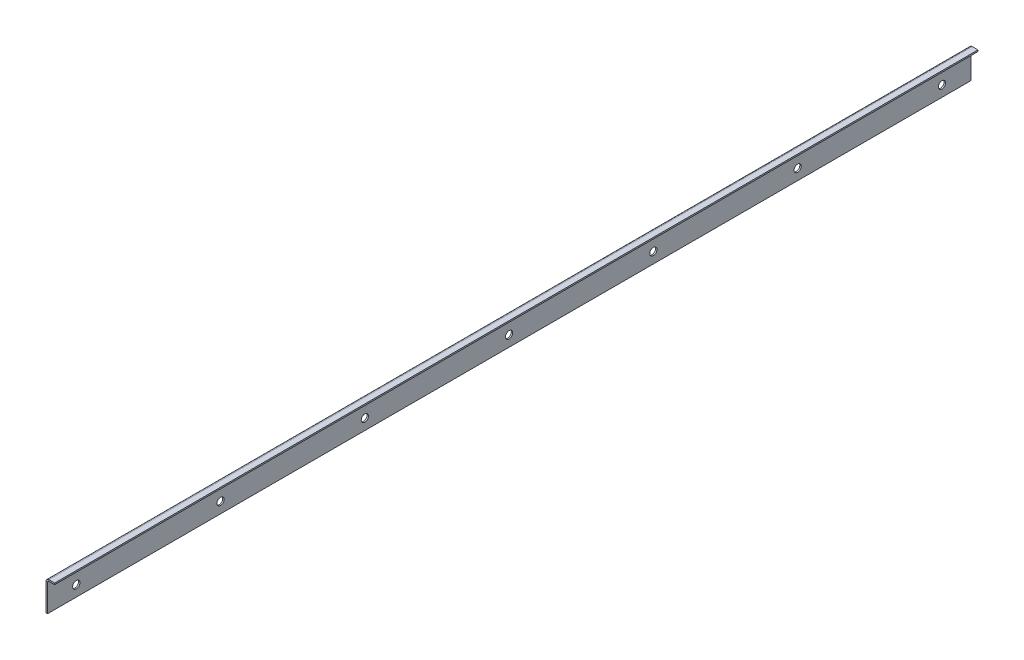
ISO-10303-21;
HEADER;
FILE_DESCRIPTION(('STEP AP214'),'2;1');
FILE_NAME('part.step','',(''),(''),'','','');
FILE_SCHEMA(('AUTOMOTIVE_DESIGN { 1 0 10303 214 1 1 1 1 }'));
ENDSEC;
DATA;
#1=APPLICATION_CONTEXT('core data for automotive mechanical design processes');
#2=APPLICATION_PROTOCOL_DEFINITION('international standard','automotive_design',2000,#1);
#3=PRODUCT_CONTEXT('',#1,'mechanical');
#4=PRODUCT('Part','Part','',(#3));
#5=PRODUCT_RELATED_PRODUCT_CATEGORY('part','',(#4));
#6=PRODUCT_DEFINITION_FORMATION('','',#4);
#7=PRODUCT_DEFINITION_CONTEXT('part definition',#1,'design');
#8=PRODUCT_DEFINITION('design','',#6,#7);
#9=PRODUCT_DEFINITION_SHAPE('','',#8);
#10=(LENGTH_UNIT() NAMED_UNIT(*) SI_UNIT(.MILLI.,.METRE.));
#11=(NAMED_UNIT(*) PLANE_ANGLE_UNIT() SI_UNIT($,.RADIAN.));
#12=(NAMED_UNIT(*) SI_UNIT($,.STERADIAN.) SOLID_ANGLE_UNIT());
#13=UNCERTAINTY_MEASURE_WITH_UNIT(LENGTH_MEASURE(1.E-05),#10,'distance_accuracy_value','');
#14=(GEOMETRIC_REPRESENTATION_CONTEXT(3) GLOBAL_UNCERTAINTY_ASSIGNED_CONTEXT((#13)) GLOBAL_UNIT_ASSIGNED_CONTEXT((#10,
#11,#12)) REPRESENTATION_CONTEXT('',''));
#15=CARTESIAN_POINT('',(0.,0.,0.));
#16=DIRECTION('',(0.,0.,1.));
#17=DIRECTION('',(1.,0.,0.));
#18=AXIS2_PLACEMENT_3D('',#15,#16,#17);
#19=CARTESIAN_POINT('',(2.,21.,320.));
#20=DIRECTION('',(0.,0.,1.));
#21=DIRECTION('',(1.,0.,0.));
#22=AXIS2_PLACEMENT_3D('',#19,#20,#21);
#23=PLANE('',#22);
#24=DIRECTION('',(0.,-1.,0.));
#25=VECTOR('',#24,1.);
#26=CARTESIAN_POINT('',(2.,21.,320.));
#27=LINE('',#26,#25);
#28=CARTESIAN_POINT('',(2.,21.,320.));
#29=VERTEX_POINT('',#28);
#30=CARTESIAN_POINT('',(2.,20.,320.));
#31=VERTEX_POINT('',#30);
#32=EDGE_CURVE('E68',#29,#31,#27,.T.);
#33=ORIENTED_EDGE('',*,*,#32,.F.);
#34=CARTESIAN_POINT('',(2.,19.,320.));
#35=DIRECTION('',(0.,0.,1.));
#36=DIRECTION('',(1.,0.,0.));
#37=AXIS2_PLACEMENT_3D('',#34,#35,#36);
#38=CIRCLE('',#37,2.);
#39=CARTESIAN_POINT('',(0.,19.,320.));
#40=VERTEX_POINT('',#39);
#41=EDGE_CURVE('E182',#40,#29,#38,.F.);
#42=ORIENTED_EDGE('',*,*,#41,.F.);
#43=DIRECTION('',(-1.,0.,0.));
#44=VECTOR('',#43,1.);
#45=CARTESIAN_POINT('',(0.999999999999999,19.,320.));
#46=LINE('',#45,#44);
#47=CARTESIAN_POINT('',(0.999999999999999,19.,320.));
#48=VERTEX_POINT('',#47);
#49=EDGE_CURVE('E75',#48,#40,#46,.T.);
#50=ORIENTED_EDGE('',*,*,#49,.F.);
#51=CARTESIAN_POINT('',(2.,19.,320.));
#52=DIRECTION('',(0.,0.,1.));
#53=DIRECTION('',(1.,0.,0.));
#54=AXIS2_PLACEMENT_3D('',#51,#52,#53);
#55=CIRCLE('',#54,1.);
#56=EDGE_CURVE('E197',#48,#31,#55,.F.);
#57=ORIENTED_EDGE('',*,*,#56,.T.);
#58=EDGE_LOOP('',(#33,#42,#50,#57));
#59=FACE_BOUND('',#58,.T.);
#60=ADVANCED_FACE('F52',(#59),#23,.T.);
#61=CARTESIAN_POINT('',(0.999999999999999,19.,320.));
#62=DIRECTION('',(0.,0.,1.));
#63=DIRECTION('',(1.,0.,0.));
#64=AXIS2_PLACEMENT_3D('',#61,#62,#63);
#65=PLANE('',#64);
#66=DIRECTION('',(1.,0.,0.));
#67=VECTOR('',#66,1.);
#68=CARTESIAN_POINT('',(0.,21.,320.));
#69=LINE('',#68,#67);
#70=CARTESIAN_POINT('',(6.,21.,320.));
#71=VERTEX_POINT('',#70);
#72=EDGE_CURVE('E178',#29,#71,#69,.T.);
#73=ORIENTED_EDGE('',*,*,#72,.F.);
#74=ORIENTED_EDGE('',*,*,#32,.T.);
#75=DIRECTION('',(1.,0.,0.));
#76=VECTOR('',#75,1.);
#77=CARTESIAN_POINT('',(0.,20.,320.));
#78=LINE('',#77,#76);
#79=CARTESIAN_POINT('',(6.,20.,320.));
#80=VERTEX_POINT('',#79);
#81=EDGE_CURVE('E173',#31,#80,#78,.T.);
#82=ORIENTED_EDGE('',*,*,#81,.T.);
#83=DIRECTION('',(0.,-1.,0.));
#84=VECTOR('',#83,1.);
#85=CARTESIAN_POINT('',(6.,21.,320.));
#86=LINE('',#85,#84);
#87=EDGE_CURVE('E126',#71,#80,#86,.T.);
#88=ORIENTED_EDGE('',*,*,#87,.F.);
#89=EDGE_LOOP('',(#73,#74,#82,#88));
#90=FACE_BOUND('',#89,.T.);
#91=ADVANCED_FACE('F286',(#90),#65,.T.);
#92=CARTESIAN_POINT('',(0.,19.,-320.));
#93=DIRECTION('',(0.,0.,-1.));
#94=DIRECTION('',(-1.,0.,0.));
#95=AXIS2_PLACEMENT_3D('',#92,#93,#94);
#96=PLANE('',#95);
#97=DIRECTION('',(1.,0.,0.));
#98=VECTOR('',#97,1.);
#99=CARTESIAN_POINT('',(0.,19.,-320.));
#100=LINE('',#99,#98);
#101=CARTESIAN_POINT('',(0.,19.,-320.));
#102=VERTEX_POINT('',#101);
#103=CARTESIAN_POINT('',(1.,19.,-320.));
#104=VERTEX_POINT('',#103);
#105=EDGE_CURVE('E224',#102,#104,#100,.T.);
#106=ORIENTED_EDGE('',*,*,#105,.F.);
#107=CARTESIAN_POINT('',(2.,19.,-320.));
#108=DIRECTION('',(0.,0.,1.));
#109=DIRECTION('',(1.,0.,0.));
#110=AXIS2_PLACEMENT_3D('',#107,#108,#109);
#111=CIRCLE('',#110,2.);
#112=CARTESIAN_POINT('',(2.,21.,-320.));
#113=VERTEX_POINT('',#112);
#114=EDGE_CURVE('E151',#102,#113,#111,.F.);
#115=ORIENTED_EDGE('',*,*,#114,.T.);
#116=DIRECTION('',(0.,1.,0.));
#117=VECTOR('',#116,1.);
#118=CARTESIAN_POINT('',(2.,20.,-320.));
#119=LINE('',#118,#117);
#120=CARTESIAN_POINT('',(2.,20.,-320.));
#121=VERTEX_POINT('',#120);
#122=EDGE_CURVE('E130',#121,#113,#119,.T.);
#123=ORIENTED_EDGE('',*,*,#122,.F.);
#124=CARTESIAN_POINT('',(2.,19.,-320.));
#125=DIRECTION('',(0.,0.,1.));
#126=DIRECTION('',(1.,0.,0.));
#127=AXIS2_PLACEMENT_3D('',#124,#125,#126);
#128=CIRCLE('',#127,1.);
#129=EDGE_CURVE('E169',#104,#121,#128,.F.);
#130=ORIENTED_EDGE('',*,*,#129,.F.);
#131=EDGE_LOOP('',(#106,#115,#123,#130));
#132=FACE_BOUND('',#131,.T.);
#133=ADVANCED_FACE('F291',(#132),#96,.T.);
#134=CARTESIAN_POINT('',(2.,20.,-320.));
#135=DIRECTION('',(0.,0.,-1.));
#136=DIRECTION('',(-1.,0.,0.));
#137=AXIS2_PLACEMENT_3D('',#134,#135,#136);
#138=PLANE('',#137);
#139=DIRECTION('',(0.,1.,0.));
#140=VECTOR('',#139,1.);
#141=CARTESIAN_POINT('',(0.,0.,-320.));
#142=LINE('',#141,#140);
#143=CARTESIAN_POINT('',(0.,0.,-320.));
#144=VERTEX_POINT('',#143);
#145=EDGE_CURVE('E158',#144,#102,#142,.T.);
#146=ORIENTED_EDGE('',*,*,#145,.T.);
#147=ORIENTED_EDGE('',*,*,#105,.T.);
#148=DIRECTION('',(0.,1.,0.));
#149=VECTOR('',#148,1.);
#150=CARTESIAN_POINT('',(1.,0.,-320.));
#151=LINE('',#150,#149);
#152=CARTESIAN_POINT('',(1.,0.,-320.));
#153=VERTEX_POINT('',#152);
#154=EDGE_CURVE('E166',#153,#104,#151,.T.);
#155=ORIENTED_EDGE('',*,*,#154,.F.);
#156=DIRECTION('',(-1.,0.,0.));
#157=VECTOR('',#156,1.);
#158=CARTESIAN_POINT('',(1.,0.,-320.));
#159=LINE('',#158,#157);
#160=EDGE_CURVE('E162',#153,#144,#159,.T.);
#161=ORIENTED_EDGE('',*,*,#160,.T.);
#162=EDGE_LOOP('',(#146,#147,#155,#161));
#163=FACE_BOUND('',#162,.T.);
#164=ADVANCED_FACE('F393',(#163),#138,.T.);
#165=CARTESIAN_POINT('',(0.,20.,320.));
#166=DIRECTION('',(0.,1.,0.));
#167=DIRECTION('',(0.,0.,1.));
#168=AXIS2_PLACEMENT_3D('',#165,#166,#167);
#169=PLANE('',#168);
#170=DIRECTION('',(1.,0.,0.));
#171=VECTOR('',#170,1.);
#172=CARTESIAN_POINT('',(0.,20.,-320.));
#173=LINE('',#172,#171);
#174=CARTESIAN_POINT('',(6.,20.,-320.));
#175=VERTEX_POINT('',#174);
#176=EDGE_CURVE('E135',#121,#175,#173,.T.);
#177=ORIENTED_EDGE('',*,*,#176,.T.);
#178=DIRECTION('',(0.,0.,-1.));
#179=VECTOR('',#178,1.);
#180=CARTESIAN_POINT('',(6.,20.,320.));
#181=LINE('',#180,#179);
#182=EDGE_CURVE('E119',#80,#175,#181,.T.);
#183=ORIENTED_EDGE('',*,*,#182,.F.);
#184=ORIENTED_EDGE('',*,*,#81,.F.);
#185=DIRECTION('',(0.,0.,-1.));
#186=VECTOR('',#185,1.);
#187=CARTESIAN_POINT('',(2.,20.,320.));
#188=LINE('',#187,#186);
#189=EDGE_CURVE('E138',#31,#121,#188,.T.);
#190=ORIENTED_EDGE('',*,*,#189,.T.);
#191=EDGE_LOOP('',(#177,#183,#184,#190));
#192=FACE_BOUND('',#191,.T.);
#193=ADVANCED_FACE('F136',(#192),#169,.F.);
#194=CARTESIAN_POINT('',(6.,21.,320.));
#195=DIRECTION('',(1.,0.,0.));
#196=DIRECTION('',(0.,0.,-1.));
#197=AXIS2_PLACEMENT_3D('',#194,#195,#196);
#198=PLANE('',#197);
#199=DIRECTION('',(0.,-1.,0.));
#200=VECTOR('',#199,1.);
#201=CARTESIAN_POINT('',(6.,21.,-320.));
#202=LINE('',#201,#200);
#203=CARTESIAN_POINT('',(6.,21.,-320.));
#204=VERTEX_POINT('',#203);
#205=EDGE_CURVE('E123',#204,#175,#202,.T.);
#206=ORIENTED_EDGE('',*,*,#205,.F.);
#207=DIRECTION('',(0.,0.,-1.));
#208=VECTOR('',#207,1.);
#209=CARTESIAN_POINT('',(6.,21.,320.));
#210=LINE('',#209,#208);
#211=EDGE_CURVE('E131',#71,#204,#210,.T.);
#212=ORIENTED_EDGE('',*,*,#211,.F.);
#213=ORIENTED_EDGE('',*,*,#87,.T.);
#214=ORIENTED_EDGE('',*,*,#182,.T.);
#215=EDGE_LOOP('',(#206,#212,#213,#214));
#216=FACE_BOUND('',#215,.T.);
#217=ADVANCED_FACE('F121',(#216),#198,.T.);
#218=CARTESIAN_POINT('',(0.,21.,320.));
#219=DIRECTION('',(0.,1.,0.));
#220=DIRECTION('',(0.,0.,1.));
#221=AXIS2_PLACEMENT_3D('',#218,#219,#220);
#222=PLANE('',#221);
#223=DIRECTION('',(1.,0.,0.));
#224=VECTOR('',#223,1.);
#225=CARTESIAN_POINT('',(0.,21.,-320.));
#226=LINE('',#225,#224);
#227=EDGE_CURVE('E145',#113,#204,#226,.T.);
#228=ORIENTED_EDGE('',*,*,#227,.F.);
#229=DIRECTION('',(0.,0.,-1.));
#230=VECTOR('',#229,1.);
#231=CARTESIAN_POINT('',(2.,21.,320.));
#232=LINE('',#231,#230);
#233=EDGE_CURVE('E216',#29,#113,#232,.T.);
#234=ORIENTED_EDGE('',*,*,#233,.F.);
#235=ORIENTED_EDGE('',*,*,#72,.T.);
#236=ORIENTED_EDGE('',*,*,#211,.T.);
#237=EDGE_LOOP('',(#228,#234,#235,#236));
#238=FACE_BOUND('',#237,.T.);
#239=ADVANCED_FACE('F280',(#238),#222,.T.);
#240=CARTESIAN_POINT('',(2.,19.,320.));
#241=DIRECTION('',(0.,0.,-1.));
#242=DIRECTION('',(-1.,0.,0.));
#243=AXIS2_PLACEMENT_3D('',#240,#241,#242);
#244=CYLINDRICAL_SURFACE('',#243,2.);
#245=ORIENTED_EDGE('',*,*,#114,.F.);
#246=DIRECTION('',(0.,0.,-1.));
#247=VECTOR('',#246,1.);
#248=CARTESIAN_POINT('',(0.,19.,320.));
#249=LINE('',#248,#247);
#250=EDGE_CURVE('E212',#40,#102,#249,.T.);
#251=ORIENTED_EDGE('',*,*,#250,.F.);
#252=ORIENTED_EDGE('',*,*,#41,.T.);
#253=ORIENTED_EDGE('',*,*,#233,.T.);
#254=EDGE_LOOP('',(#245,#251,#252,#253));
#255=FACE_BOUND('',#254,.T.);
#256=ADVANCED_FACE('F270',(#255),#244,.T.);
#257=CARTESIAN_POINT('',(0.,0.,320.));
#258=DIRECTION('',(-1.,0.,0.));
#259=DIRECTION('',(0.,0.,1.));
#260=AXIS2_PLACEMENT_3D('',#257,#258,#259);
#261=PLANE('',#260);
#262=CARTESIAN_POINT('',(0.,7.50000000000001,-200.));
#263=DIRECTION('',(-1.,0.,0.));
#264=DIRECTION('',(0.,0.,1.));
#265=AXIS2_PLACEMENT_3D('',#262,#263,#264);
#266=CIRCLE('',#265,2.50000000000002);
#267=CARTESIAN_POINT('',(0.,7.50000000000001,-197.5));
#268=VERTEX_POINT('',#267);
#269=EDGE_CURVE('E347',#268,#268,#266,.T.);
#270=ORIENTED_EDGE('',*,*,#269,.F.);
#271=EDGE_LOOP('',(#270));
#272=FACE_BOUND('',#271,.T.);
#273=CARTESIAN_POINT('',(0.,7.50000000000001,-300.));
#274=DIRECTION('',(-1.,0.,0.));
#275=DIRECTION('',(0.,0.,1.));
#276=AXIS2_PLACEMENT_3D('',#273,#274,#275);
#277=CIRCLE('',#276,2.50000000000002);
#278=CARTESIAN_POINT('',(0.,7.50000000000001,-297.5));
#279=VERTEX_POINT('',#278);
#280=EDGE_CURVE('E351',#279,#279,#277,.T.);
#281=ORIENTED_EDGE('',*,*,#280,.F.);
#282=EDGE_LOOP('',(#281));
#283=FACE_BOUND('',#282,.T.);
#284=ORIENTED_EDGE('',*,*,#145,.F.);
#285=DIRECTION('',(0.,0.,-1.));
#286=VECTOR('',#285,1.);
#287=CARTESIAN_POINT('',(0.,0.,320.));
#288=LINE('',#287,#286);
#289=CARTESIAN_POINT('',(0.,0.,320.));
#290=VERTEX_POINT('',#289);
#291=EDGE_CURVE('E209',#290,#144,#288,.T.);
#292=ORIENTED_EDGE('',*,*,#291,.F.);
#293=DIRECTION('',(0.,1.,0.));
#294=VECTOR('',#293,1.);
#295=CARTESIAN_POINT('',(0.,0.,320.));
#296=LINE('',#295,#294);
#297=EDGE_CURVE('E186',#290,#40,#296,.T.);
#298=ORIENTED_EDGE('',*,*,#297,.T.);
#299=ORIENTED_EDGE('',*,*,#250,.T.);
#300=EDGE_LOOP('',(#284,#292,#298,#299));
#301=FACE_BOUND('',#300,.T.);
#302=CARTESIAN_POINT('',(0.,7.50000000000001,-100.));
#303=DIRECTION('',(-1.,0.,0.));
#304=DIRECTION('',(0.,0.,1.));
#305=AXIS2_PLACEMENT_3D('',#302,#303,#304);
#306=CIRCLE('',#305,2.50000000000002);
#307=CARTESIAN_POINT('',(0.,7.50000000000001,-97.5));
#308=VERTEX_POINT('',#307);
#309=EDGE_CURVE('E230',#308,#308,#306,.T.);
#310=ORIENTED_EDGE('',*,*,#309,.F.);
#311=EDGE_LOOP('',(#310));
#312=FACE_BOUND('',#311,.T.);
#313=CARTESIAN_POINT('',(0.,7.50000000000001,0.));
#314=DIRECTION('',(-1.,0.,0.));
#315=DIRECTION('',(0.,0.,1.));
#316=AXIS2_PLACEMENT_3D('',#313,#314,#315);
#317=CIRCLE('',#316,2.50000000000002);
#318=CARTESIAN_POINT('',(0.,7.50000000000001,2.50000000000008));
#319=VERTEX_POINT('',#318);
#320=EDGE_CURVE('E238',#319,#319,#317,.T.);
#321=ORIENTED_EDGE('',*,*,#320,.F.);
#322=EDGE_LOOP('',(#321));
#323=FACE_BOUND('',#322,.T.);
#324=CARTESIAN_POINT('',(0.,7.50000000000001,100.));
#325=DIRECTION('',(-1.,0.,0.));
#326=DIRECTION('',(0.,0.,1.));
#327=AXIS2_PLACEMENT_3D('',#324,#325,#326);
#328=CIRCLE('',#327,2.50000000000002);
#329=CARTESIAN_POINT('',(0.,7.50000000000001,102.5));
#330=VERTEX_POINT('',#329);
#331=EDGE_CURVE('E246',#330,#330,#328,.T.);
#332=ORIENTED_EDGE('',*,*,#331,.F.);
#333=EDGE_LOOP('',(#332));
#334=FACE_BOUND('',#333,.T.);
#335=CARTESIAN_POINT('',(0.,7.50000000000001,200.));
#336=DIRECTION('',(-1.,0.,0.));
#337=DIRECTION('',(0.,0.,1.));
#338=AXIS2_PLACEMENT_3D('',#335,#336,#337);
#339=CIRCLE('',#338,2.50000000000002);
#340=CARTESIAN_POINT('',(0.,7.50000000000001,202.5));
#341=VERTEX_POINT('',#340);
#342=EDGE_CURVE('E254',#341,#341,#339,.T.);
#343=ORIENTED_EDGE('',*,*,#342,.F.);
#344=EDGE_LOOP('',(#343));
#345=FACE_BOUND('',#344,.T.);
#346=CARTESIAN_POINT('',(0.,7.50000000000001,300.));
#347=DIRECTION('',(-1.,0.,0.));
#348=DIRECTION('',(0.,0.,1.));
#349=AXIS2_PLACEMENT_3D('',#346,#347,#348);
#350=CIRCLE('',#349,2.50000000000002);
#351=CARTESIAN_POINT('',(0.,7.50000000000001,302.5));
#352=VERTEX_POINT('',#351);
#353=EDGE_CURVE('E61',#352,#352,#350,.T.);
#354=ORIENTED_EDGE('',*,*,#353,.F.);
#355=EDGE_LOOP('',(#354));
#356=FACE_BOUND('',#355,.T.);
#357=ADVANCED_FACE('F267',(#272,#283,#301,#312,#323,#334,#345,#356),#261,.T.);
#358=CARTESIAN_POINT('',(0.999999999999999,0.,320.));
#359=DIRECTION('',(0.,-1.,0.));
#360=DIRECTION('',(0.,0.,-1.));
#361=AXIS2_PLACEMENT_3D('',#358,#359,#360);
#362=PLANE('',#361);
#363=ORIENTED_EDGE('',*,*,#160,.F.);
#364=DIRECTION('',(0.,0.,-1.));
#365=VECTOR('',#364,1.);
#366=CARTESIAN_POINT('',(0.999999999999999,0.,320.));
#367=LINE('',#366,#365);
#368=CARTESIAN_POINT('',(0.999999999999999,0.,320.));
#369=VERTEX_POINT('',#368);
#370=EDGE_CURVE('E206',#369,#153,#367,.T.);
#371=ORIENTED_EDGE('',*,*,#370,.F.);
#372=DIRECTION('',(-1.,0.,0.));
#373=VECTOR('',#372,1.);
#374=CARTESIAN_POINT('',(0.999999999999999,0.,320.));
#375=LINE('',#374,#373);
#376=EDGE_CURVE('E190',#369,#290,#375,.T.);
#377=ORIENTED_EDGE('',*,*,#376,.T.);
#378=ORIENTED_EDGE('',*,*,#291,.T.);
#379=EDGE_LOOP('',(#363,#371,#377,#378));
#380=FACE_BOUND('',#379,.T.);
#381=ADVANCED_FACE('F269',(#380),#362,.T.);
#382=CARTESIAN_POINT('',(0.999999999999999,0.,320.));
#383=DIRECTION('',(-1.,0.,0.));
#384=DIRECTION('',(0.,0.,1.));
#385=AXIS2_PLACEMENT_3D('',#382,#383,#384);
#386=PLANE('',#385);
#387=CARTESIAN_POINT('',(0.999999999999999,7.50000000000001,-200.));
#388=DIRECTION('',(-1.,0.,0.));
#389=DIRECTION('',(0.,0.,1.));
#390=AXIS2_PLACEMENT_3D('',#387,#388,#389);
#391=CIRCLE('',#390,2.50000000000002);
#392=CARTESIAN_POINT('',(0.999999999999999,7.50000000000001,-197.5));
#393=VERTEX_POINT('',#392);
#394=EDGE_CURVE('E349',#393,#393,#391,.F.);
#395=ORIENTED_EDGE('',*,*,#394,.F.);
#396=EDGE_LOOP('',(#395));
#397=FACE_BOUND('',#396,.T.);
#398=CARTESIAN_POINT('',(1.,7.50000000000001,-300.));
#399=DIRECTION('',(-1.,0.,0.));
#400=DIRECTION('',(0.,0.,1.));
#401=AXIS2_PLACEMENT_3D('',#398,#399,#400);
#402=CIRCLE('',#401,2.50000000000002);
#403=CARTESIAN_POINT('',(1.,7.50000000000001,-297.5));
#404=VERTEX_POINT('',#403);
#405=EDGE_CURVE('E141',#404,#404,#402,.F.);
#406=ORIENTED_EDGE('',*,*,#405,.F.);
#407=EDGE_LOOP('',(#406));
#408=FACE_BOUND('',#407,.T.);
#409=ORIENTED_EDGE('',*,*,#154,.T.);
#410=DIRECTION('',(0.,0.,-1.));
#411=VECTOR('',#410,1.);
#412=CARTESIAN_POINT('',(0.999999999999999,19.,320.));
#413=LINE('',#412,#411);
#414=EDGE_CURVE('E202',#48,#104,#413,.T.);
#415=ORIENTED_EDGE('',*,*,#414,.F.);
#416=DIRECTION('',(0.,1.,0.));
#417=VECTOR('',#416,1.);
#418=CARTESIAN_POINT('',(0.999999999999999,0.,320.));
#419=LINE('',#418,#417);
#420=EDGE_CURVE('E194',#369,#48,#419,.T.);
#421=ORIENTED_EDGE('',*,*,#420,.F.);
#422=ORIENTED_EDGE('',*,*,#370,.T.);
#423=EDGE_LOOP('',(#409,#415,#421,#422));
#424=FACE_BOUND('',#423,.T.);
#425=CARTESIAN_POINT('',(1.,7.50000000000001,-100.));
#426=DIRECTION('',(-1.,0.,0.));
#427=DIRECTION('',(0.,0.,1.));
#428=AXIS2_PLACEMENT_3D('',#425,#426,#427);
#429=CIRCLE('',#428,2.50000000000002);
#430=CARTESIAN_POINT('',(1.,7.50000000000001,-97.5));
#431=VERTEX_POINT('',#430);
#432=EDGE_CURVE('E234',#431,#431,#429,.F.);
#433=ORIENTED_EDGE('',*,*,#432,.F.);
#434=EDGE_LOOP('',(#433));
#435=FACE_BOUND('',#434,.T.);
#436=CARTESIAN_POINT('',(1.,7.50000000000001,0.));
#437=DIRECTION('',(-1.,0.,0.));
#438=DIRECTION('',(0.,0.,1.));
#439=AXIS2_PLACEMENT_3D('',#436,#437,#438);
#440=CIRCLE('',#439,2.50000000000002);
#441=CARTESIAN_POINT('',(1.,7.50000000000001,2.50000000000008));
#442=VERTEX_POINT('',#441);
#443=EDGE_CURVE('E242',#442,#442,#440,.F.);
#444=ORIENTED_EDGE('',*,*,#443,.F.);
#445=EDGE_LOOP('',(#444));
#446=FACE_BOUND('',#445,.T.);
#447=CARTESIAN_POINT('',(1.,7.50000000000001,100.));
#448=DIRECTION('',(-1.,0.,0.));
#449=DIRECTION('',(0.,0.,1.));
#450=AXIS2_PLACEMENT_3D('',#447,#448,#449);
#451=CIRCLE('',#450,2.50000000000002);
#452=CARTESIAN_POINT('',(1.,7.50000000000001,102.5));
#453=VERTEX_POINT('',#452);
#454=EDGE_CURVE('E250',#453,#453,#451,.F.);
#455=ORIENTED_EDGE('',*,*,#454,.F.);
#456=EDGE_LOOP('',(#455));
#457=FACE_BOUND('',#456,.T.);
#458=CARTESIAN_POINT('',(1.,7.50000000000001,200.));
#459=DIRECTION('',(-1.,0.,0.));
#460=DIRECTION('',(0.,0.,1.));
#461=AXIS2_PLACEMENT_3D('',#458,#459,#460);
#462=CIRCLE('',#461,2.50000000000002);
#463=CARTESIAN_POINT('',(1.,7.50000000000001,202.5));
#464=VERTEX_POINT('',#463);
#465=EDGE_CURVE('E258',#464,#464,#462,.F.);
#466=ORIENTED_EDGE('',*,*,#465,.F.);
#467=EDGE_LOOP('',(#466));
#468=FACE_BOUND('',#467,.T.);
#469=CARTESIAN_POINT('',(1.,7.50000000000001,300.));
#470=DIRECTION('',(-1.,0.,0.));
#471=DIRECTION('',(0.,0.,1.));
#472=AXIS2_PLACEMENT_3D('',#469,#470,#471);
#473=CIRCLE('',#472,2.50000000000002);
#474=CARTESIAN_POINT('',(1.,7.50000000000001,302.5));
#475=VERTEX_POINT('',#474);
#476=EDGE_CURVE('E11',#475,#475,#473,.F.);
#477=ORIENTED_EDGE('',*,*,#476,.F.);
#478=EDGE_LOOP('',(#477));
#479=FACE_BOUND('',#478,.T.);
#480=ADVANCED_FACE('F277',(#397,#408,#424,#435,#446,#457,#468,#479),#386,.F.);
#481=CARTESIAN_POINT('',(2.,19.,320.));
#482=DIRECTION('',(0.,0.,-1.));
#483=DIRECTION('',(-1.,0.,0.));
#484=AXIS2_PLACEMENT_3D('',#481,#482,#483);
#485=CYLINDRICAL_SURFACE('',#484,1.);
#486=ORIENTED_EDGE('',*,*,#129,.T.);
#487=ORIENTED_EDGE('',*,*,#189,.F.);
#488=ORIENTED_EDGE('',*,*,#56,.F.);
#489=ORIENTED_EDGE('',*,*,#414,.T.);
#490=EDGE_LOOP('',(#486,#487,#488,#489));
#491=FACE_BOUND('',#490,.T.);
#492=ADVANCED_FACE('F319',(#491),#485,.F.);
#493=CARTESIAN_POINT('',(2.,19.,320.));
#494=DIRECTION('',(0.,0.,1.));
#495=DIRECTION('',(1.,0.,0.));
#496=AXIS2_PLACEMENT_3D('',#493,#494,#495);
#497=PLANE('',#496);
#498=ORIENTED_EDGE('',*,*,#420,.T.);
#499=ORIENTED_EDGE('',*,*,#49,.T.);
#500=ORIENTED_EDGE('',*,*,#297,.F.);
#501=ORIENTED_EDGE('',*,*,#376,.F.);
#502=EDGE_LOOP('',(#498,#499,#500,#501));
#503=FACE_BOUND('',#502,.T.);
#504=ADVANCED_FACE('F326',(#503),#497,.T.);
#505=CARTESIAN_POINT('',(2.,19.,-320.));
#506=DIRECTION('',(0.,0.,1.));
#507=DIRECTION('',(1.,0.,0.));
#508=AXIS2_PLACEMENT_3D('',#505,#506,#507);
#509=PLANE('',#508);
#510=ORIENTED_EDGE('',*,*,#176,.F.);
#511=ORIENTED_EDGE('',*,*,#122,.T.);
#512=ORIENTED_EDGE('',*,*,#227,.T.);
#513=ORIENTED_EDGE('',*,*,#205,.T.);
#514=EDGE_LOOP('',(#510,#511,#512,#513));
#515=FACE_BOUND('',#514,.T.);
#516=ADVANCED_FACE('F143',(#515),#509,.F.);
#517=CARTESIAN_POINT('',(6.001,7.50000000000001,-300.));
#518=DIRECTION('',(-1.,0.,0.));
#519=DIRECTION('',(0.,0.,1.));
#520=AXIS2_PLACEMENT_3D('',#517,#518,#519);
#521=CYLINDRICAL_SURFACE('',#520,2.50000000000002);
#522=CARTESIAN_POINT('',(0.,7.50000000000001,-297.5));
#523=CARTESIAN_POINT('',(0.0104166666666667,7.50000000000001,-297.5));
#524=CARTESIAN_POINT('',(0.0208333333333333,7.50000000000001,-297.5));
#525=CARTESIAN_POINT('',(0.0416666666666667,7.50000000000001,-297.5));
#526=CARTESIAN_POINT('',(0.0520833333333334,7.50000000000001,-297.5));
#527=CARTESIAN_POINT('',(0.0729166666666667,7.50000000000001,-297.5));
#528=CARTESIAN_POINT('',(0.0833333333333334,7.50000000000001,-297.5));
#529=CARTESIAN_POINT('',(0.104166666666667,7.50000000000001,-297.5));
#530=CARTESIAN_POINT('',(0.114583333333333,7.50000000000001,-297.5));
#531=CARTESIAN_POINT('',(0.135416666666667,7.50000000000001,-297.5));
#532=CARTESIAN_POINT('',(0.145833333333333,7.50000000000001,-297.5));
#533=CARTESIAN_POINT('',(0.166666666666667,7.50000000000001,-297.5));
#534=CARTESIAN_POINT('',(0.177083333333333,7.50000000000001,-297.5));
#535=CARTESIAN_POINT('',(0.197916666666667,7.50000000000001,-297.5));
#536=CARTESIAN_POINT('',(0.208333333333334,7.50000000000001,-297.5));
#537=CARTESIAN_POINT('',(0.229166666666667,7.50000000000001,-297.5));
#538=CARTESIAN_POINT('',(0.239583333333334,7.50000000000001,-297.5));
#539=CARTESIAN_POINT('',(0.260416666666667,7.50000000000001,-297.5));
#540=CARTESIAN_POINT('',(0.270833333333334,7.50000000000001,-297.5));
#541=CARTESIAN_POINT('',(0.291666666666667,7.50000000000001,-297.5));
#542=CARTESIAN_POINT('',(0.302083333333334,7.50000000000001,-297.5));
#543=CARTESIAN_POINT('',(0.322916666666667,7.50000000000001,-297.5));
#544=CARTESIAN_POINT('',(0.333333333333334,7.50000000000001,-297.5));
#545=CARTESIAN_POINT('',(0.354166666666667,7.50000000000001,-297.5));
#546=CARTESIAN_POINT('',(0.364583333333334,7.50000000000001,-297.5));
#547=CARTESIAN_POINT('',(0.385416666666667,7.50000000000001,-297.5));
#548=CARTESIAN_POINT('',(0.395833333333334,7.50000000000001,-297.5));
#549=CARTESIAN_POINT('',(0.416666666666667,7.50000000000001,-297.5));
#550=CARTESIAN_POINT('',(0.427083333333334,7.50000000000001,-297.5));
#551=CARTESIAN_POINT('',(0.447916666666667,7.50000000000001,-297.5));
#552=CARTESIAN_POINT('',(0.458333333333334,7.50000000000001,-297.5));
#553=CARTESIAN_POINT('',(0.479166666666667,7.50000000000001,-297.5));
#554=CARTESIAN_POINT('',(0.489583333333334,7.50000000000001,-297.5));
#555=CARTESIAN_POINT('',(0.510416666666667,7.50000000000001,-297.5));
#556=CARTESIAN_POINT('',(0.520833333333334,7.50000000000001,-297.5));
#557=CARTESIAN_POINT('',(0.541666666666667,7.50000000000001,-297.5));
#558=CARTESIAN_POINT('',(0.552083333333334,7.50000000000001,-297.5));
#559=CARTESIAN_POINT('',(0.572916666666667,7.50000000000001,-297.5));
#560=CARTESIAN_POINT('',(0.583333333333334,7.50000000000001,-297.5));
#561=CARTESIAN_POINT('',(0.604166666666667,7.50000000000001,-297.5));
#562=CARTESIAN_POINT('',(0.614583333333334,7.50000000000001,-297.5));
#563=CARTESIAN_POINT('',(0.635416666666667,7.50000000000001,-297.5));
#564=CARTESIAN_POINT('',(0.645833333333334,7.50000000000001,-297.5));
#565=CARTESIAN_POINT('',(0.666666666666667,7.50000000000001,-297.5));
#566=CARTESIAN_POINT('',(0.677083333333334,7.50000000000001,-297.5));
#567=CARTESIAN_POINT('',(0.697916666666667,7.50000000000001,-297.5));
#568=CARTESIAN_POINT('',(0.708333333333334,7.50000000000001,-297.5));
#569=CARTESIAN_POINT('',(0.729166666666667,7.50000000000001,-297.5));
#570=CARTESIAN_POINT('',(0.739583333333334,7.50000000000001,-297.5));
#571=CARTESIAN_POINT('',(0.760416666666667,7.50000000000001,-297.5));
#572=CARTESIAN_POINT('',(0.770833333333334,7.50000000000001,-297.5));
#573=CARTESIAN_POINT('',(0.791666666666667,7.50000000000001,-297.5));
#574=CARTESIAN_POINT('',(0.802083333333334,7.50000000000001,-297.5));
#575=CARTESIAN_POINT('',(0.822916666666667,7.50000000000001,-297.5));
#576=CARTESIAN_POINT('',(0.833333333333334,7.50000000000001,-297.5));
#577=CARTESIAN_POINT('',(0.854166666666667,7.50000000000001,-297.5));
#578=CARTESIAN_POINT('',(0.864583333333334,7.50000000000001,-297.5));
#579=CARTESIAN_POINT('',(0.885416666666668,7.50000000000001,-297.5));
#580=CARTESIAN_POINT('',(0.895833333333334,7.50000000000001,-297.5));
#581=CARTESIAN_POINT('',(0.916666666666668,7.50000000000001,-297.5));
#582=CARTESIAN_POINT('',(0.927083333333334,7.50000000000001,-297.5));
#583=CARTESIAN_POINT('',(0.947916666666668,7.50000000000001,-297.5));
#584=CARTESIAN_POINT('',(0.958333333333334,7.50000000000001,-297.5));
#585=CARTESIAN_POINT('',(0.979166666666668,7.50000000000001,-297.5));
#586=CARTESIAN_POINT('',(0.989583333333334,7.50000000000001,-297.5));
#587=CARTESIAN_POINT('',(1.,7.50000000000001,-297.5));
#588=B_SPLINE_CURVE_WITH_KNOTS('',3,(#522,#523,#524,#525,#526,#527,#528,#529,#530,#531,#532,
#533,#534,#535,#536,#537,#538,#539,#540,#541,#542,#543,#544,#545,#546,#547,#548,#549,#550,#551,
#552,#553,#554,#555,#556,#557,#558,#559,#560,#561,#562,#563,#564,#565,#566,#567,#568,#569,#570,
#571,#572,#573,#574,#575,#576,#577,#578,#579,#580,#581,#582,#583,#584,#585,#586,#587),
.UNSPECIFIED.,.F.,.F.,(4,2,2,2,2,2,2,2,2,2,2,2,2,2,2,2,2,2,2,2,2,2,2,2,2,2,2,2,2,2,2,2,4),(0.,
0.03125,0.0625000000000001,0.0937500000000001,0.125,0.15625,0.1875,0.21875,0.25,0.28125,0.3125,
0.34375,0.375,0.40625,0.4375,0.46875,0.5,0.53125,0.5625,0.593750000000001,0.625000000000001,
0.656250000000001,0.687500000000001,0.718750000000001,0.750000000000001,0.781250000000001,
0.812500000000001,0.843750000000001,0.875000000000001,0.906250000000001,0.937500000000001,
0.968750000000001,1.),.UNSPECIFIED.);
#589=EDGE_CURVE('BSEAM337',#279,#404,#588,.T.);
#590=ORIENTED_EDGE('',*,*,#280,.T.);
#591=ORIENTED_EDGE('',*,*,#405,.T.);
#592=ORIENTED_EDGE('',*,*,#589,.T.);
#593=ORIENTED_EDGE('',*,*,#589,.F.);
#594=EDGE_LOOP('',(#590,#592,#591,#593));
#595=FACE_BOUND('',#594,.T.);
#596=ADVANCED_FACE('F337',(#595),#521,.F.);
#597=CARTESIAN_POINT('',(6.001,7.50000000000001,-200.));
#598=DIRECTION('',(-1.,0.,0.));
#599=DIRECTION('',(0.,0.,1.));
#600=AXIS2_PLACEMENT_3D('',#597,#598,#599);
#601=CYLINDRICAL_SURFACE('',#600,2.50000000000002);
#602=CARTESIAN_POINT('',(0.,7.50000000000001,-197.5));
#603=CARTESIAN_POINT('',(0.0104166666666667,7.50000000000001,-197.5));
#604=CARTESIAN_POINT('',(0.0208333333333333,7.50000000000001,-197.5));
#605=CARTESIAN_POINT('',(0.0416666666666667,7.50000000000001,-197.5));
#606=CARTESIAN_POINT('',(0.0520833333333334,7.50000000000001,-197.5));
#607=CARTESIAN_POINT('',(0.0729166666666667,7.50000000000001,-197.5));
#608=CARTESIAN_POINT('',(0.0833333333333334,7.50000000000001,-197.5));
#609=CARTESIAN_POINT('',(0.104166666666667,7.50000000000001,-197.5));
#610=CARTESIAN_POINT('',(0.114583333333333,7.50000000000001,-197.5));
#611=CARTESIAN_POINT('',(0.135416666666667,7.50000000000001,-197.5));
#612=CARTESIAN_POINT('',(0.145833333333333,7.50000000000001,-197.5));
#613=CARTESIAN_POINT('',(0.166666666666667,7.50000000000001,-197.5));
#614=CARTESIAN_POINT('',(0.177083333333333,7.50000000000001,-197.5));
#615=CARTESIAN_POINT('',(0.197916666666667,7.50000000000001,-197.5));
#616=CARTESIAN_POINT('',(0.208333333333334,7.50000000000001,-197.5));
#617=CARTESIAN_POINT('',(0.229166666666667,7.50000000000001,-197.5));
#618=CARTESIAN_POINT('',(0.239583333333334,7.50000000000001,-197.5));
#619=CARTESIAN_POINT('',(0.260416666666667,7.50000000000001,-197.5));
#620=CARTESIAN_POINT('',(0.270833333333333,7.50000000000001,-197.5));
#621=CARTESIAN_POINT('',(0.291666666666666,7.50000000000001,-197.5));
#622=CARTESIAN_POINT('',(0.302083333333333,7.50000000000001,-197.5));
#623=CARTESIAN_POINT('',(0.322916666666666,7.50000000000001,-197.5));
#624=CARTESIAN_POINT('',(0.333333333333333,7.50000000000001,-197.5));
#625=CARTESIAN_POINT('',(0.354166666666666,7.50000000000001,-197.5));
#626=CARTESIAN_POINT('',(0.364583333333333,7.50000000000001,-197.5));
#627=CARTESIAN_POINT('',(0.385416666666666,7.50000000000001,-197.5));
#628=CARTESIAN_POINT('',(0.395833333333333,7.50000000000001,-197.5));
#629=CARTESIAN_POINT('',(0.416666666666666,7.50000000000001,-197.5));
#630=CARTESIAN_POINT('',(0.427083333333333,7.50000000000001,-197.5));
#631=CARTESIAN_POINT('',(0.447916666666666,7.50000000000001,-197.5));
#632=CARTESIAN_POINT('',(0.458333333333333,7.50000000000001,-197.5));
#633=CARTESIAN_POINT('',(0.479166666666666,7.50000000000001,-197.5));
#634=CARTESIAN_POINT('',(0.489583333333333,7.50000000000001,-197.5));
#635=CARTESIAN_POINT('',(0.510416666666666,7.50000000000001,-197.5));
#636=CARTESIAN_POINT('',(0.520833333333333,7.50000000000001,-197.5));
#637=CARTESIAN_POINT('',(0.541666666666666,7.50000000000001,-197.5));
#638=CARTESIAN_POINT('',(0.552083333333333,7.50000000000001,-197.5));
#639=CARTESIAN_POINT('',(0.572916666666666,7.50000000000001,-197.5));
#640=CARTESIAN_POINT('',(0.583333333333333,7.50000000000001,-197.5));
#641=CARTESIAN_POINT('',(0.604166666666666,7.50000000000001,-197.5));
#642=CARTESIAN_POINT('',(0.614583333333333,7.50000000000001,-197.5));
#643=CARTESIAN_POINT('',(0.635416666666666,7.50000000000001,-197.5));
#644=CARTESIAN_POINT('',(0.645833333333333,7.50000000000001,-197.5));
#645=CARTESIAN_POINT('',(0.666666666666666,7.50000000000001,-197.5));
#646=CARTESIAN_POINT('',(0.677083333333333,7.50000000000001,-197.5));
#647=CARTESIAN_POINT('',(0.697916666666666,7.50000000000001,-197.5));
#648=CARTESIAN_POINT('',(0.708333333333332,7.50000000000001,-197.5));
#649=CARTESIAN_POINT('',(0.729166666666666,7.50000000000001,-197.5));
#650=CARTESIAN_POINT('',(0.739583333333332,7.50000000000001,-197.5));
#651=CARTESIAN_POINT('',(0.760416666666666,7.50000000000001,-197.5));
#652=CARTESIAN_POINT('',(0.770833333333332,7.50000000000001,-197.5));
#653=CARTESIAN_POINT('',(0.791666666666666,7.50000000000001,-197.5));
#654=CARTESIAN_POINT('',(0.802083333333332,7.50000000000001,-197.5));
#655=CARTESIAN_POINT('',(0.822916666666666,7.50000000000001,-197.5));
#656=CARTESIAN_POINT('',(0.833333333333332,7.50000000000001,-197.5));
#657=CARTESIAN_POINT('',(0.854166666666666,7.50000000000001,-197.5));
#658=CARTESIAN_POINT('',(0.864583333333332,7.50000000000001,-197.5));
#659=CARTESIAN_POINT('',(0.885416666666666,7.50000000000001,-197.5));
#660=CARTESIAN_POINT('',(0.895833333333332,7.50000000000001,-197.5));
#661=CARTESIAN_POINT('',(0.916666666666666,7.50000000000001,-197.5));
#662=CARTESIAN_POINT('',(0.927083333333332,7.50000000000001,-197.5));
#663=CARTESIAN_POINT('',(0.947916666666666,7.50000000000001,-197.5));
#664=CARTESIAN_POINT('',(0.958333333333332,7.50000000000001,-197.5));
#665=CARTESIAN_POINT('',(0.979166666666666,7.50000000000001,-197.5));
#666=CARTESIAN_POINT('',(0.989583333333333,7.50000000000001,-197.5));
#667=CARTESIAN_POINT('',(0.999999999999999,7.50000000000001,-197.5));
#668=B_SPLINE_CURVE_WITH_KNOTS('',3,(#602,#603,#604,#605,#606,#607,#608,#609,#610,#611,#612,
#613,#614,#615,#616,#617,#618,#619,#620,#621,#622,#623,#624,#625,#626,#627,#628,#629,#630,#631,
#632,#633,#634,#635,#636,#637,#638,#639,#640,#641,#642,#643,#644,#645,#646,#647,#648,#649,#650,
#651,#652,#653,#654,#655,#656,#657,#658,#659,#660,#661,#662,#663,#664,#665,#666,#667),
.UNSPECIFIED.,.F.,.F.,(4,2,2,2,2,2,2,2,2,2,2,2,2,2,2,2,2,2,2,2,2,2,2,2,2,2,2,2,2,2,2,2,4),(0.,
0.03125,0.0625000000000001,0.0937500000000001,0.125,0.15625,0.1875,0.21875,0.25,
0.281249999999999,0.312499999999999,0.343749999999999,0.374999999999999,0.40625,0.4375,0.46875,
0.5,0.53125,0.5625,0.59375,0.625,0.65625,0.6875,0.718749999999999,0.749999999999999,
0.781249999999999,0.812499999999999,0.843749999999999,0.874999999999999,0.906249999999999,
0.937499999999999,0.968749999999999,0.999999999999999),.UNSPECIFIED.);
#669=EDGE_CURVE('BSEAM299',#268,#393,#668,.T.);
#670=ORIENTED_EDGE('',*,*,#269,.T.);
#671=ORIENTED_EDGE('',*,*,#394,.T.);
#672=ORIENTED_EDGE('',*,*,#669,.T.);
#673=ORIENTED_EDGE('',*,*,#669,.F.);
#674=EDGE_LOOP('',(#670,#672,#671,#673));
#675=FACE_BOUND('',#674,.T.);
#676=ADVANCED_FACE('F299',(#675),#601,.F.);
#677=CARTESIAN_POINT('',(6.001,7.50000000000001,-100.));
#678=DIRECTION('',(-1.,0.,0.));
#679=DIRECTION('',(0.,0.,1.));
#680=AXIS2_PLACEMENT_3D('',#677,#678,#679);
#681=CYLINDRICAL_SURFACE('',#680,2.50000000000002);
#682=CARTESIAN_POINT('',(0.,7.50000000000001,-97.5));
#683=CARTESIAN_POINT('',(0.0104166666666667,7.50000000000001,-97.5));
#684=CARTESIAN_POINT('',(0.0208333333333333,7.50000000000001,-97.5));
#685=CARTESIAN_POINT('',(0.0416666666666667,7.50000000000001,-97.5));
#686=CARTESIAN_POINT('',(0.0520833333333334,7.50000000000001,-97.5));
#687=CARTESIAN_POINT('',(0.0729166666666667,7.50000000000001,-97.5));
#688=CARTESIAN_POINT('',(0.0833333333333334,7.50000000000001,-97.5));
#689=CARTESIAN_POINT('',(0.104166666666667,7.50000000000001,-97.5));
#690=CARTESIAN_POINT('',(0.114583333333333,7.50000000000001,-97.5));
#691=CARTESIAN_POINT('',(0.135416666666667,7.50000000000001,-97.5));
#692=CARTESIAN_POINT('',(0.145833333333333,7.50000000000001,-97.5));
#693=CARTESIAN_POINT('',(0.166666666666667,7.50000000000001,-97.5));
#694=CARTESIAN_POINT('',(0.177083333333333,7.50000000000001,-97.5));
#695=CARTESIAN_POINT('',(0.197916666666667,7.50000000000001,-97.5));
#696=CARTESIAN_POINT('',(0.208333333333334,7.50000000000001,-97.5));
#697=CARTESIAN_POINT('',(0.229166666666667,7.50000000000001,-97.5));
#698=CARTESIAN_POINT('',(0.239583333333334,7.50000000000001,-97.5));
#699=CARTESIAN_POINT('',(0.260416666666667,7.50000000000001,-97.5));
#700=CARTESIAN_POINT('',(0.270833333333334,7.50000000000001,-97.5));
#701=CARTESIAN_POINT('',(0.291666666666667,7.50000000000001,-97.5));
#702=CARTESIAN_POINT('',(0.302083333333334,7.50000000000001,-97.5));
#703=CARTESIAN_POINT('',(0.322916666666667,7.50000000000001,-97.5));
#704=CARTESIAN_POINT('',(0.333333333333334,7.50000000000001,-97.5));
#705=CARTESIAN_POINT('',(0.354166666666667,7.50000000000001,-97.5));
#706=CARTESIAN_POINT('',(0.364583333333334,7.50000000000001,-97.5));
#707=CARTESIAN_POINT('',(0.385416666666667,7.50000000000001,-97.5));
#708=CARTESIAN_POINT('',(0.395833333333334,7.50000000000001,-97.5));
#709=CARTESIAN_POINT('',(0.416666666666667,7.50000000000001,-97.5));
#710=CARTESIAN_POINT('',(0.427083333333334,7.50000000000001,-97.5));
#711=CARTESIAN_POINT('',(0.447916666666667,7.50000000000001,-97.5));
#712=CARTESIAN_POINT('',(0.458333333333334,7.50000000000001,-97.5));
#713=CARTESIAN_POINT('',(0.479166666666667,7.50000000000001,-97.5));
#714=CARTESIAN_POINT('',(0.489583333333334,7.50000000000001,-97.5));
#715=CARTESIAN_POINT('',(0.510416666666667,7.50000000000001,-97.5));
#716=CARTESIAN_POINT('',(0.520833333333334,7.50000000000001,-97.5));
#717=CARTESIAN_POINT('',(0.541666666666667,7.50000000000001,-97.5));
#718=CARTESIAN_POINT('',(0.552083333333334,7.50000000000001,-97.5));
#719=CARTESIAN_POINT('',(0.572916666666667,7.50000000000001,-97.5));
#720=CARTESIAN_POINT('',(0.583333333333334,7.50000000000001,-97.5));
#721=CARTESIAN_POINT('',(0.604166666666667,7.50000000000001,-97.5));
#722=CARTESIAN_POINT('',(0.614583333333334,7.50000000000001,-97.5));
#723=CARTESIAN_POINT('',(0.635416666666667,7.50000000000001,-97.5));
#724=CARTESIAN_POINT('',(0.645833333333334,7.50000000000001,-97.5));
#725=CARTESIAN_POINT('',(0.666666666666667,7.50000000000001,-97.5));
#726=CARTESIAN_POINT('',(0.677083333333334,7.50000000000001,-97.5));
#727=CARTESIAN_POINT('',(0.697916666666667,7.50000000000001,-97.5));
#728=CARTESIAN_POINT('',(0.708333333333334,7.50000000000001,-97.5));
#729=CARTESIAN_POINT('',(0.729166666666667,7.50000000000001,-97.5));
#730=CARTESIAN_POINT('',(0.739583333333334,7.50000000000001,-97.5));
#731=CARTESIAN_POINT('',(0.760416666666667,7.50000000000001,-97.5));
#732=CARTESIAN_POINT('',(0.770833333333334,7.50000000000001,-97.5));
#733=CARTESIAN_POINT('',(0.791666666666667,7.50000000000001,-97.5));
#734=CARTESIAN_POINT('',(0.802083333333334,7.50000000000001,-97.5));
#735=CARTESIAN_POINT('',(0.822916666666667,7.50000000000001,-97.5));
#736=CARTESIAN_POINT('',(0.833333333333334,7.50000000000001,-97.5));
#737=CARTESIAN_POINT('',(0.854166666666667,7.50000000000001,-97.5));
#738=CARTESIAN_POINT('',(0.864583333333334,7.50000000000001,-97.5));
#739=CARTESIAN_POINT('',(0.885416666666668,7.50000000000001,-97.5));
#740=CARTESIAN_POINT('',(0.895833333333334,7.50000000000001,-97.5));
#741=CARTESIAN_POINT('',(0.916666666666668,7.50000000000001,-97.5));
#742=CARTESIAN_POINT('',(0.927083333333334,7.50000000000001,-97.5));
#743=CARTESIAN_POINT('',(0.947916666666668,7.50000000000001,-97.5));
#744=CARTESIAN_POINT('',(0.958333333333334,7.50000000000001,-97.5));
#745=CARTESIAN_POINT('',(0.979166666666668,7.50000000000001,-97.5));
#746=CARTESIAN_POINT('',(0.989583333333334,7.50000000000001,-97.5));
#747=CARTESIAN_POINT('',(1.,7.50000000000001,-97.5));
#748=B_SPLINE_CURVE_WITH_KNOTS('',3,(#682,#683,#684,#685,#686,#687,#688,#689,#690,#691,#692,
#693,#694,#695,#696,#697,#698,#699,#700,#701,#702,#703,#704,#705,#706,#707,#708,#709,#710,#711,
#712,#713,#714,#715,#716,#717,#718,#719,#720,#721,#722,#723,#724,#725,#726,#727,#728,#729,#730,
#731,#732,#733,#734,#735,#736,#737,#738,#739,#740,#741,#742,#743,#744,#745,#746,#747),
.UNSPECIFIED.,.F.,.F.,(4,2,2,2,2,2,2,2,2,2,2,2,2,2,2,2,2,2,2,2,2,2,2,2,2,2,2,2,2,2,2,2,4),(0.,
0.03125,0.0625000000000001,0.0937500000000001,0.125,0.15625,0.1875,0.21875,0.25,0.28125,0.3125,
0.34375,0.375,0.40625,0.4375,0.46875,0.5,0.53125,0.5625,0.593750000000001,0.625000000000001,
0.656250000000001,0.687500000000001,0.718750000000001,0.750000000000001,0.781250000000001,
0.812500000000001,0.843750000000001,0.875000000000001,0.906250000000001,0.937500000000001,
0.968750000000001,1.),.UNSPECIFIED.);
#749=EDGE_CURVE('BSEAM295',#308,#431,#748,.T.);
#750=ORIENTED_EDGE('',*,*,#309,.T.);
#751=ORIENTED_EDGE('',*,*,#432,.T.);
#752=ORIENTED_EDGE('',*,*,#749,.T.);
#753=ORIENTED_EDGE('',*,*,#749,.F.);
#754=EDGE_LOOP('',(#750,#752,#751,#753));
#755=FACE_BOUND('',#754,.T.);
#756=ADVANCED_FACE('F295',(#755),#681,.F.);
#757=CARTESIAN_POINT('',(6.001,7.50000000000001,0.));
#758=DIRECTION('',(-1.,0.,0.));
#759=DIRECTION('',(0.,0.,1.));
#760=AXIS2_PLACEMENT_3D('',#757,#758,#759);
#761=CYLINDRICAL_SURFACE('',#760,2.50000000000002);
#762=CARTESIAN_POINT('',(0.,7.50000000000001,2.50000000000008));
#763=CARTESIAN_POINT('',(0.0104166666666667,7.50000000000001,2.50000000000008));
#764=CARTESIAN_POINT('',(0.0208333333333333,7.50000000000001,2.50000000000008));
#765=CARTESIAN_POINT('',(0.0416666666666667,7.50000000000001,2.50000000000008));
#766=CARTESIAN_POINT('',(0.0520833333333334,7.50000000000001,2.50000000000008));
#767=CARTESIAN_POINT('',(0.0729166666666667,7.50000000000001,2.50000000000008));
#768=CARTESIAN_POINT('',(0.0833333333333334,7.50000000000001,2.50000000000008));
#769=CARTESIAN_POINT('',(0.104166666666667,7.50000000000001,2.50000000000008));
#770=CARTESIAN_POINT('',(0.114583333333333,7.50000000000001,2.50000000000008));
#771=CARTESIAN_POINT('',(0.135416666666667,7.50000000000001,2.50000000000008));
#772=CARTESIAN_POINT('',(0.145833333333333,7.50000000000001,2.50000000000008));
#773=CARTESIAN_POINT('',(0.166666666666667,7.50000000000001,2.50000000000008));
#774=CARTESIAN_POINT('',(0.177083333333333,7.50000000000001,2.50000000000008));
#775=CARTESIAN_POINT('',(0.197916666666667,7.50000000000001,2.50000000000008));
#776=CARTESIAN_POINT('',(0.208333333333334,7.50000000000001,2.50000000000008));
#777=CARTESIAN_POINT('',(0.229166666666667,7.50000000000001,2.50000000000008));
#778=CARTESIAN_POINT('',(0.239583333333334,7.50000000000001,2.50000000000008));
#779=CARTESIAN_POINT('',(0.260416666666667,7.50000000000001,2.50000000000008));
#780=CARTESIAN_POINT('',(0.270833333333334,7.50000000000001,2.50000000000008));
#781=CARTESIAN_POINT('',(0.291666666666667,7.50000000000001,2.50000000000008));
#782=CARTESIAN_POINT('',(0.302083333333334,7.50000000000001,2.50000000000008));
#783=CARTESIAN_POINT('',(0.322916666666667,7.50000000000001,2.50000000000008));
#784=CARTESIAN_POINT('',(0.333333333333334,7.50000000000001,2.50000000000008));
#785=CARTESIAN_POINT('',(0.354166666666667,7.50000000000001,2.50000000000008));
#786=CARTESIAN_POINT('',(0.364583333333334,7.50000000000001,2.50000000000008));
#787=CARTESIAN_POINT('',(0.385416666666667,7.50000000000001,2.50000000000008));
#788=CARTESIAN_POINT('',(0.395833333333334,7.50000000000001,2.50000000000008));
#789=CARTESIAN_POINT('',(0.416666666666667,7.50000000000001,2.50000000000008));
#790=CARTESIAN_POINT('',(0.427083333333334,7.50000000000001,2.50000000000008));
#791=CARTESIAN_POINT('',(0.447916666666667,7.50000000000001,2.50000000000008));
#792=CARTESIAN_POINT('',(0.458333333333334,7.50000000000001,2.50000000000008));
#793=CARTESIAN_POINT('',(0.479166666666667,7.50000000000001,2.50000000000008));
#794=CARTESIAN_POINT('',(0.489583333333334,7.50000000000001,2.50000000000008));
#795=CARTESIAN_POINT('',(0.510416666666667,7.50000000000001,2.50000000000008));
#796=CARTESIAN_POINT('',(0.520833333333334,7.50000000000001,2.50000000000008));
#797=CARTESIAN_POINT('',(0.541666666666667,7.50000000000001,2.50000000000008));
#798=CARTESIAN_POINT('',(0.552083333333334,7.50000000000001,2.50000000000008));
#799=CARTESIAN_POINT('',(0.572916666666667,7.50000000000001,2.50000000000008));
#800=CARTESIAN_POINT('',(0.583333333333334,7.50000000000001,2.50000000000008));
#801=CARTESIAN_POINT('',(0.604166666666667,7.50000000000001,2.50000000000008));
#802=CARTESIAN_POINT('',(0.614583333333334,7.50000000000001,2.50000000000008));
#803=CARTESIAN_POINT('',(0.635416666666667,7.50000000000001,2.50000000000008));
#804=CARTESIAN_POINT('',(0.645833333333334,7.50000000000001,2.50000000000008));
#805=CARTESIAN_POINT('',(0.666666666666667,7.50000000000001,2.50000000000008));
#806=CARTESIAN_POINT('',(0.677083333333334,7.50000000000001,2.50000000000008));
#807=CARTESIAN_POINT('',(0.697916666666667,7.50000000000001,2.50000000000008));
#808=CARTESIAN_POINT('',(0.708333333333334,7.50000000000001,2.50000000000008));
#809=CARTESIAN_POINT('',(0.729166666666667,7.50000000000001,2.50000000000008));
#810=CARTESIAN_POINT('',(0.739583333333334,7.50000000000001,2.50000000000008));
#811=CARTESIAN_POINT('',(0.760416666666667,7.50000000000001,2.50000000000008));
#812=CARTESIAN_POINT('',(0.770833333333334,7.50000000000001,2.50000000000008));
#813=CARTESIAN_POINT('',(0.791666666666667,7.50000000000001,2.50000000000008));
#814=CARTESIAN_POINT('',(0.802083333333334,7.50000000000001,2.50000000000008));
#815=CARTESIAN_POINT('',(0.822916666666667,7.50000000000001,2.50000000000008));
#816=CARTESIAN_POINT('',(0.833333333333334,7.50000000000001,2.50000000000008));
#817=CARTESIAN_POINT('',(0.854166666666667,7.50000000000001,2.50000000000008));
#818=CARTESIAN_POINT('',(0.864583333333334,7.50000000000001,2.50000000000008));
#819=CARTESIAN_POINT('',(0.885416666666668,7.50000000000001,2.50000000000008));
#820=CARTESIAN_POINT('',(0.895833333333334,7.50000000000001,2.50000000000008));
#821=CARTESIAN_POINT('',(0.916666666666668,7.50000000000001,2.50000000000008));
#822=CARTESIAN_POINT('',(0.927083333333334,7.50000000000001,2.50000000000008));
#823=CARTESIAN_POINT('',(0.947916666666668,7.50000000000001,2.50000000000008));
#824=CARTESIAN_POINT('',(0.958333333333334,7.50000000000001,2.50000000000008));
#825=CARTESIAN_POINT('',(0.979166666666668,7.50000000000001,2.50000000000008));
#826=CARTESIAN_POINT('',(0.989583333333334,7.50000000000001,2.50000000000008));
#827=CARTESIAN_POINT('',(1.,7.50000000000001,2.50000000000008));
#828=B_SPLINE_CURVE_WITH_KNOTS('',3,(#762,#763,#764,#765,#766,#767,#768,#769,#770,#771,#772,
#773,#774,#775,#776,#777,#778,#779,#780,#781,#782,#783,#784,#785,#786,#787,#788,#789,#790,#791,
#792,#793,#794,#795,#796,#797,#798,#799,#800,#801,#802,#803,#804,#805,#806,#807,#808,#809,#810,
#811,#812,#813,#814,#815,#816,#817,#818,#819,#820,#821,#822,#823,#824,#825,#826,#827),
.UNSPECIFIED.,.F.,.F.,(4,2,2,2,2,2,2,2,2,2,2,2,2,2,2,2,2,2,2,2,2,2,2,2,2,2,2,2,2,2,2,2,4),(0.,
0.03125,0.0625000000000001,0.0937500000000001,0.125,0.15625,0.1875,0.21875,0.25,0.28125,0.3125,
0.34375,0.375,0.40625,0.4375,0.46875,0.5,0.53125,0.5625,0.593750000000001,0.625000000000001,
0.656250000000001,0.687500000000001,0.718750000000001,0.750000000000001,0.781250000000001,
0.812500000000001,0.843750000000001,0.875000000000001,0.906250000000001,0.937500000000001,
0.968750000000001,1.),.UNSPECIFIED.);
#829=EDGE_CURVE('BSEAM298',#319,#442,#828,.T.);
#830=ORIENTED_EDGE('',*,*,#320,.T.);
#831=ORIENTED_EDGE('',*,*,#443,.T.);
#832=ORIENTED_EDGE('',*,*,#829,.T.);
#833=ORIENTED_EDGE('',*,*,#829,.F.);
#834=EDGE_LOOP('',(#830,#832,#831,#833));
#835=FACE_BOUND('',#834,.T.);
#836=ADVANCED_FACE('F298',(#835),#761,.F.);
#837=CARTESIAN_POINT('',(6.001,7.50000000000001,100.));
#838=DIRECTION('',(-1.,0.,0.));
#839=DIRECTION('',(0.,0.,1.));
#840=AXIS2_PLACEMENT_3D('',#837,#838,#839);
#841=CYLINDRICAL_SURFACE('',#840,2.50000000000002);
#842=CARTESIAN_POINT('',(0.,7.50000000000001,102.5));
#843=CARTESIAN_POINT('',(0.0104166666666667,7.50000000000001,102.5));
#844=CARTESIAN_POINT('',(0.0208333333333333,7.50000000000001,102.5));
#845=CARTESIAN_POINT('',(0.0416666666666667,7.50000000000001,102.5));
#846=CARTESIAN_POINT('',(0.0520833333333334,7.50000000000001,102.5));
#847=CARTESIAN_POINT('',(0.0729166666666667,7.50000000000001,102.5));
#848=CARTESIAN_POINT('',(0.0833333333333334,7.50000000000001,102.5));
#849=CARTESIAN_POINT('',(0.104166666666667,7.50000000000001,102.5));
#850=CARTESIAN_POINT('',(0.114583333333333,7.50000000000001,102.5));
#851=CARTESIAN_POINT('',(0.135416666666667,7.50000000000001,102.5));
#852=CARTESIAN_POINT('',(0.145833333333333,7.50000000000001,102.5));
#853=CARTESIAN_POINT('',(0.166666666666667,7.50000000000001,102.5));
#854=CARTESIAN_POINT('',(0.177083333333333,7.50000000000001,102.5));
#855=CARTESIAN_POINT('',(0.197916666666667,7.50000000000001,102.5));
#856=CARTESIAN_POINT('',(0.208333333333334,7.50000000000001,102.5));
#857=CARTESIAN_POINT('',(0.229166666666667,7.50000000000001,102.5));
#858=CARTESIAN_POINT('',(0.239583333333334,7.50000000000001,102.5));
#859=CARTESIAN_POINT('',(0.260416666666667,7.50000000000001,102.5));
#860=CARTESIAN_POINT('',(0.270833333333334,7.50000000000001,102.5));
#861=CARTESIAN_POINT('',(0.291666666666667,7.50000000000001,102.5));
#862=CARTESIAN_POINT('',(0.302083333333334,7.50000000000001,102.5));
#863=CARTESIAN_POINT('',(0.322916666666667,7.50000000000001,102.5));
#864=CARTESIAN_POINT('',(0.333333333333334,7.50000000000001,102.5));
#865=CARTESIAN_POINT('',(0.354166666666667,7.50000000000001,102.5));
#866=CARTESIAN_POINT('',(0.364583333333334,7.50000000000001,102.5));
#867=CARTESIAN_POINT('',(0.385416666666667,7.50000000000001,102.5));
#868=CARTESIAN_POINT('',(0.395833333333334,7.50000000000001,102.5));
#869=CARTESIAN_POINT('',(0.416666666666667,7.50000000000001,102.5));
#870=CARTESIAN_POINT('',(0.427083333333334,7.50000000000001,102.5));
#871=CARTESIAN_POINT('',(0.447916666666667,7.50000000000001,102.5));
#872=CARTESIAN_POINT('',(0.458333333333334,7.50000000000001,102.5));
#873=CARTESIAN_POINT('',(0.479166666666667,7.50000000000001,102.5));
#874=CARTESIAN_POINT('',(0.489583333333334,7.50000000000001,102.5));
#875=CARTESIAN_POINT('',(0.510416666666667,7.50000000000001,102.5));
#876=CARTESIAN_POINT('',(0.520833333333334,7.50000000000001,102.5));
#877=CARTESIAN_POINT('',(0.541666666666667,7.50000000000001,102.5));
#878=CARTESIAN_POINT('',(0.552083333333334,7.50000000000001,102.5));
#879=CARTESIAN_POINT('',(0.572916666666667,7.50000000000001,102.5));
#880=CARTESIAN_POINT('',(0.583333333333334,7.50000000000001,102.5));
#881=CARTESIAN_POINT('',(0.604166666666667,7.50000000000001,102.5));
#882=CARTESIAN_POINT('',(0.614583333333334,7.50000000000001,102.5));
#883=CARTESIAN_POINT('',(0.635416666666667,7.50000000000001,102.5));
#884=CARTESIAN_POINT('',(0.645833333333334,7.50000000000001,102.5));
#885=CARTESIAN_POINT('',(0.666666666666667,7.50000000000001,102.5));
#886=CARTESIAN_POINT('',(0.677083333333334,7.50000000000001,102.5));
#887=CARTESIAN_POINT('',(0.697916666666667,7.50000000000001,102.5));
#888=CARTESIAN_POINT('',(0.708333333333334,7.50000000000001,102.5));
#889=CARTESIAN_POINT('',(0.729166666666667,7.50000000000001,102.5));
#890=CARTESIAN_POINT('',(0.739583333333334,7.50000000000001,102.5));
#891=CARTESIAN_POINT('',(0.760416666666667,7.50000000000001,102.5));
#892=CARTESIAN_POINT('',(0.770833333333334,7.50000000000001,102.5));
#893=CARTESIAN_POINT('',(0.791666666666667,7.50000000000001,102.5));
#894=CARTESIAN_POINT('',(0.802083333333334,7.50000000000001,102.5));
#895=CARTESIAN_POINT('',(0.822916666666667,7.50000000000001,102.5));
#896=CARTESIAN_POINT('',(0.833333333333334,7.50000000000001,102.5));
#897=CARTESIAN_POINT('',(0.854166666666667,7.50000000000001,102.5));
#898=CARTESIAN_POINT('',(0.864583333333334,7.50000000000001,102.5));
#899=CARTESIAN_POINT('',(0.885416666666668,7.50000000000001,102.5));
#900=CARTESIAN_POINT('',(0.895833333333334,7.50000000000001,102.5));
#901=CARTESIAN_POINT('',(0.916666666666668,7.50000000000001,102.5));
#902=CARTESIAN_POINT('',(0.927083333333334,7.50000000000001,102.5));
#903=CARTESIAN_POINT('',(0.947916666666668,7.50000000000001,102.5));
#904=CARTESIAN_POINT('',(0.958333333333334,7.50000000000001,102.5));
#905=CARTESIAN_POINT('',(0.979166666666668,7.50000000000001,102.5));
#906=CARTESIAN_POINT('',(0.989583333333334,7.50000000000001,102.5));
#907=CARTESIAN_POINT('',(1.,7.50000000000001,102.5));
#908=B_SPLINE_CURVE_WITH_KNOTS('',3,(#842,#843,#844,#845,#846,#847,#848,#849,#850,#851,#852,
#853,#854,#855,#856,#857,#858,#859,#860,#861,#862,#863,#864,#865,#866,#867,#868,#869,#870,#871,
#872,#873,#874,#875,#876,#877,#878,#879,#880,#881,#882,#883,#884,#885,#886,#887,#888,#889,#890,
#891,#892,#893,#894,#895,#896,#897,#898,#899,#900,#901,#902,#903,#904,#905,#906,#907),
.UNSPECIFIED.,.F.,.F.,(4,2,2,2,2,2,2,2,2,2,2,2,2,2,2,2,2,2,2,2,2,2,2,2,2,2,2,2,2,2,2,2,4),(0.,
0.03125,0.0625000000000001,0.0937500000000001,0.125,0.15625,0.1875,0.21875,0.25,0.28125,0.3125,
0.34375,0.375,0.40625,0.4375,0.46875,0.5,0.53125,0.5625,0.593750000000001,0.625000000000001,
0.656250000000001,0.687500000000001,0.718750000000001,0.750000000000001,0.781250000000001,
0.812500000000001,0.843750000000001,0.875000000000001,0.906250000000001,0.937500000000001,
0.968750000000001,1.),.UNSPECIFIED.);
#909=EDGE_CURVE('BSEAM303',#330,#453,#908,.T.);
#910=ORIENTED_EDGE('',*,*,#331,.T.);
#911=ORIENTED_EDGE('',*,*,#454,.T.);
#912=ORIENTED_EDGE('',*,*,#909,.T.);
#913=ORIENTED_EDGE('',*,*,#909,.F.);
#914=EDGE_LOOP('',(#910,#912,#911,#913));
#915=FACE_BOUND('',#914,.T.);
#916=ADVANCED_FACE('F303',(#915),#841,.F.);
#917=CARTESIAN_POINT('',(6.001,7.50000000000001,200.));
#918=DIRECTION('',(-1.,0.,0.));
#919=DIRECTION('',(0.,0.,1.));
#920=AXIS2_PLACEMENT_3D('',#917,#918,#919);
#921=CYLINDRICAL_SURFACE('',#920,2.50000000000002);
#922=CARTESIAN_POINT('',(0.,7.50000000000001,202.5));
#923=CARTESIAN_POINT('',(0.0104166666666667,7.50000000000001,202.5));
#924=CARTESIAN_POINT('',(0.0208333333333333,7.50000000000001,202.5));
#925=CARTESIAN_POINT('',(0.0416666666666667,7.50000000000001,202.5));
#926=CARTESIAN_POINT('',(0.0520833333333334,7.50000000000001,202.5));
#927=CARTESIAN_POINT('',(0.0729166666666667,7.50000000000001,202.5));
#928=CARTESIAN_POINT('',(0.0833333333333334,7.50000000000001,202.5));
#929=CARTESIAN_POINT('',(0.104166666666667,7.50000000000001,202.5));
#930=CARTESIAN_POINT('',(0.114583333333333,7.50000000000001,202.5));
#931=CARTESIAN_POINT('',(0.135416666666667,7.50000000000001,202.5));
#932=CARTESIAN_POINT('',(0.145833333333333,7.50000000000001,202.5));
#933=CARTESIAN_POINT('',(0.166666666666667,7.50000000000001,202.5));
#934=CARTESIAN_POINT('',(0.177083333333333,7.50000000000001,202.5));
#935=CARTESIAN_POINT('',(0.197916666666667,7.50000000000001,202.5));
#936=CARTESIAN_POINT('',(0.208333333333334,7.50000000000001,202.5));
#937=CARTESIAN_POINT('',(0.229166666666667,7.50000000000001,202.5));
#938=CARTESIAN_POINT('',(0.239583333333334,7.50000000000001,202.5));
#939=CARTESIAN_POINT('',(0.260416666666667,7.50000000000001,202.5));
#940=CARTESIAN_POINT('',(0.270833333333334,7.50000000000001,202.5));
#941=CARTESIAN_POINT('',(0.291666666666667,7.50000000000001,202.5));
#942=CARTESIAN_POINT('',(0.302083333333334,7.50000000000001,202.5));
#943=CARTESIAN_POINT('',(0.322916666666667,7.50000000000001,202.5));
#944=CARTESIAN_POINT('',(0.333333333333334,7.50000000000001,202.5));
#945=CARTESIAN_POINT('',(0.354166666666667,7.50000000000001,202.5));
#946=CARTESIAN_POINT('',(0.364583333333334,7.50000000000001,202.5));
#947=CARTESIAN_POINT('',(0.385416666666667,7.50000000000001,202.5));
#948=CARTESIAN_POINT('',(0.395833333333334,7.50000000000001,202.5));
#949=CARTESIAN_POINT('',(0.416666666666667,7.50000000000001,202.5));
#950=CARTESIAN_POINT('',(0.427083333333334,7.50000000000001,202.5));
#951=CARTESIAN_POINT('',(0.447916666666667,7.50000000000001,202.5));
#952=CARTESIAN_POINT('',(0.458333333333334,7.50000000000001,202.5));
#953=CARTESIAN_POINT('',(0.479166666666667,7.50000000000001,202.5));
#954=CARTESIAN_POINT('',(0.489583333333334,7.50000000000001,202.5));
#955=CARTESIAN_POINT('',(0.510416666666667,7.50000000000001,202.5));
#956=CARTESIAN_POINT('',(0.520833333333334,7.50000000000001,202.5));
#957=CARTESIAN_POINT('',(0.541666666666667,7.50000000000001,202.5));
#958=CARTESIAN_POINT('',(0.552083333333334,7.50000000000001,202.5));
#959=CARTESIAN_POINT('',(0.572916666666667,7.50000000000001,202.5));
#960=CARTESIAN_POINT('',(0.583333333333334,7.50000000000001,202.5));
#961=CARTESIAN_POINT('',(0.604166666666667,7.50000000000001,202.5));
#962=CARTESIAN_POINT('',(0.614583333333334,7.50000000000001,202.5));
#963=CARTESIAN_POINT('',(0.635416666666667,7.50000000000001,202.5));
#964=CARTESIAN_POINT('',(0.645833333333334,7.50000000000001,202.5));
#965=CARTESIAN_POINT('',(0.666666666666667,7.50000000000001,202.5));
#966=CARTESIAN_POINT('',(0.677083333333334,7.50000000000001,202.5));
#967=CARTESIAN_POINT('',(0.697916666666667,7.50000000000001,202.5));
#968=CARTESIAN_POINT('',(0.708333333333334,7.50000000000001,202.5));
#969=CARTESIAN_POINT('',(0.729166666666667,7.50000000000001,202.5));
#970=CARTESIAN_POINT('',(0.739583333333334,7.50000000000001,202.5));
#971=CARTESIAN_POINT('',(0.760416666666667,7.50000000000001,202.5));
#972=CARTESIAN_POINT('',(0.770833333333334,7.50000000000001,202.5));
#973=CARTESIAN_POINT('',(0.791666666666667,7.50000000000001,202.5));
#974=CARTESIAN_POINT('',(0.802083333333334,7.50000000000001,202.5));
#975=CARTESIAN_POINT('',(0.822916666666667,7.50000000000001,202.5));
#976=CARTESIAN_POINT('',(0.833333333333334,7.50000000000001,202.5));
#977=CARTESIAN_POINT('',(0.854166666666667,7.50000000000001,202.5));
#978=CARTESIAN_POINT('',(0.864583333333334,7.50000000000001,202.5));
#979=CARTESIAN_POINT('',(0.885416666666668,7.50000000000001,202.5));
#980=CARTESIAN_POINT('',(0.895833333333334,7.50000000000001,202.5));
#981=CARTESIAN_POINT('',(0.916666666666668,7.50000000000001,202.5));
#982=CARTESIAN_POINT('',(0.927083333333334,7.50000000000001,202.5));
#983=CARTESIAN_POINT('',(0.947916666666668,7.50000000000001,202.5));
#984=CARTESIAN_POINT('',(0.958333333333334,7.50000000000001,202.5));
#985=CARTESIAN_POINT('',(0.979166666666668,7.50000000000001,202.5));
#986=CARTESIAN_POINT('',(0.989583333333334,7.50000000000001,202.5));
#987=CARTESIAN_POINT('',(1.,7.50000000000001,202.5));
#988=B_SPLINE_CURVE_WITH_KNOTS('',3,(#922,#923,#924,#925,#926,#927,#928,#929,#930,#931,#932,
#933,#934,#935,#936,#937,#938,#939,#940,#941,#942,#943,#944,#945,#946,#947,#948,#949,#950,#951,
#952,#953,#954,#955,#956,#957,#958,#959,#960,#961,#962,#963,#964,#965,#966,#967,#968,#969,#970,
#971,#972,#973,#974,#975,#976,#977,#978,#979,#980,#981,#982,#983,#984,#985,#986,#987),
.UNSPECIFIED.,.F.,.F.,(4,2,2,2,2,2,2,2,2,2,2,2,2,2,2,2,2,2,2,2,2,2,2,2,2,2,2,2,2,2,2,2,4),(0.,
0.03125,0.0625000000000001,0.0937500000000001,0.125,0.15625,0.1875,0.21875,0.25,0.28125,0.3125,
0.34375,0.375,0.40625,0.4375,0.46875,0.5,0.53125,0.5625,0.593750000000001,0.625000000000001,
0.656250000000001,0.687500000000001,0.718750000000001,0.750000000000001,0.781250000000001,
0.812500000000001,0.843750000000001,0.875000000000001,0.906250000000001,0.937500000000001,
0.968750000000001,1.),.UNSPECIFIED.);
#989=EDGE_CURVE('BSEAM306',#341,#464,#988,.T.);
#990=ORIENTED_EDGE('',*,*,#342,.T.);
#991=ORIENTED_EDGE('',*,*,#465,.T.);
#992=ORIENTED_EDGE('',*,*,#989,.T.);
#993=ORIENTED_EDGE('',*,*,#989,.F.);
#994=EDGE_LOOP('',(#990,#992,#991,#993));
#995=FACE_BOUND('',#994,.T.);
#996=ADVANCED_FACE('F306',(#995),#921,.F.);
#997=CARTESIAN_POINT('',(6.001,7.50000000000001,300.));
#998=DIRECTION('',(-1.,0.,0.));
#999=DIRECTION('',(0.,0.,1.));
#1000=AXIS2_PLACEMENT_3D('',#997,#998,#999);
#1001=CYLINDRICAL_SURFACE('',#1000,2.50000000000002);
#1002=CARTESIAN_POINT('',(0.,7.50000000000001,302.5));
#1003=CARTESIAN_POINT('',(0.0104166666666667,7.50000000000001,302.5));
#1004=CARTESIAN_POINT('',(0.0208333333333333,7.50000000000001,302.5));
#1005=CARTESIAN_POINT('',(0.0416666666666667,7.50000000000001,302.5));
#1006=CARTESIAN_POINT('',(0.0520833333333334,7.50000000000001,302.5));
#1007=CARTESIAN_POINT('',(0.0729166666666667,7.50000000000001,302.5));
#1008=CARTESIAN_POINT('',(0.0833333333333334,7.50000000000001,302.5));
#1009=CARTESIAN_POINT('',(0.104166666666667,7.50000000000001,302.5));
#1010=CARTESIAN_POINT('',(0.114583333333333,7.50000000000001,302.5));
#1011=CARTESIAN_POINT('',(0.135416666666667,7.50000000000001,302.5));
#1012=CARTESIAN_POINT('',(0.145833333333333,7.50000000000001,302.5));
#1013=CARTESIAN_POINT('',(0.166666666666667,7.50000000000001,302.5));
#1014=CARTESIAN_POINT('',(0.177083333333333,7.50000000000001,302.5));
#1015=CARTESIAN_POINT('',(0.197916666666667,7.50000000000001,302.5));
#1016=CARTESIAN_POINT('',(0.208333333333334,7.50000000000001,302.5));
#1017=CARTESIAN_POINT('',(0.229166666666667,7.50000000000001,302.5));
#1018=CARTESIAN_POINT('',(0.239583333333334,7.50000000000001,302.5));
#1019=CARTESIAN_POINT('',(0.260416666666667,7.50000000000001,302.5));
#1020=CARTESIAN_POINT('',(0.270833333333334,7.50000000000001,302.5));
#1021=CARTESIAN_POINT('',(0.291666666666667,7.50000000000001,302.5));
#1022=CARTESIAN_POINT('',(0.302083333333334,7.50000000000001,302.5));
#1023=CARTESIAN_POINT('',(0.322916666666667,7.50000000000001,302.5));
#1024=CARTESIAN_POINT('',(0.333333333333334,7.50000000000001,302.5));
#1025=CARTESIAN_POINT('',(0.354166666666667,7.50000000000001,302.5));
#1026=CARTESIAN_POINT('',(0.364583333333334,7.50000000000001,302.5));
#1027=CARTESIAN_POINT('',(0.385416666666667,7.50000000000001,302.5));
#1028=CARTESIAN_POINT('',(0.395833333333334,7.50000000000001,302.5));
#1029=CARTESIAN_POINT('',(0.416666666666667,7.50000000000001,302.5));
#1030=CARTESIAN_POINT('',(0.427083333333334,7.50000000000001,302.5));
#1031=CARTESIAN_POINT('',(0.447916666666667,7.50000000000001,302.5));
#1032=CARTESIAN_POINT('',(0.458333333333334,7.50000000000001,302.5));
#1033=CARTESIAN_POINT('',(0.479166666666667,7.50000000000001,302.5));
#1034=CARTESIAN_POINT('',(0.489583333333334,7.50000000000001,302.5));
#1035=CARTESIAN_POINT('',(0.510416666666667,7.50000000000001,302.5));
#1036=CARTESIAN_POINT('',(0.520833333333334,7.50000000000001,302.5));
#1037=CARTESIAN_POINT('',(0.541666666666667,7.50000000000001,302.5));
#1038=CARTESIAN_POINT('',(0.552083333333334,7.50000000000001,302.5));
#1039=CARTESIAN_POINT('',(0.572916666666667,7.50000000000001,302.5));
#1040=CARTESIAN_POINT('',(0.583333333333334,7.50000000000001,302.5));
#1041=CARTESIAN_POINT('',(0.604166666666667,7.50000000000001,302.5));
#1042=CARTESIAN_POINT('',(0.614583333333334,7.50000000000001,302.5));
#1043=CARTESIAN_POINT('',(0.635416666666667,7.50000000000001,302.5));
#1044=CARTESIAN_POINT('',(0.645833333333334,7.50000000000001,302.5));
#1045=CARTESIAN_POINT('',(0.666666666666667,7.50000000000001,302.5));
#1046=CARTESIAN_POINT('',(0.677083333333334,7.50000000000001,302.5));
#1047=CARTESIAN_POINT('',(0.697916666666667,7.50000000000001,302.5));
#1048=CARTESIAN_POINT('',(0.708333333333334,7.50000000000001,302.5));
#1049=CARTESIAN_POINT('',(0.729166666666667,7.50000000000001,302.5));
#1050=CARTESIAN_POINT('',(0.739583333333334,7.50000000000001,302.5));
#1051=CARTESIAN_POINT('',(0.760416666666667,7.50000000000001,302.5));
#1052=CARTESIAN_POINT('',(0.770833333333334,7.50000000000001,302.5));
#1053=CARTESIAN_POINT('',(0.791666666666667,7.50000000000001,302.5));
#1054=CARTESIAN_POINT('',(0.802083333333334,7.50000000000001,302.5));
#1055=CARTESIAN_POINT('',(0.822916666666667,7.50000000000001,302.5));
#1056=CARTESIAN_POINT('',(0.833333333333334,7.50000000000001,302.5));
#1057=CARTESIAN_POINT('',(0.854166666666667,7.50000000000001,302.5));
#1058=CARTESIAN_POINT('',(0.864583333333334,7.50000000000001,302.5));
#1059=CARTESIAN_POINT('',(0.885416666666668,7.50000000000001,302.5));
#1060=CARTESIAN_POINT('',(0.895833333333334,7.50000000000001,302.5));
#1061=CARTESIAN_POINT('',(0.916666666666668,7.50000000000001,302.5));
#1062=CARTESIAN_POINT('',(0.927083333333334,7.50000000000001,302.5));
#1063=CARTESIAN_POINT('',(0.947916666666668,7.50000000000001,302.5));
#1064=CARTESIAN_POINT('',(0.958333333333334,7.50000000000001,302.5));
#1065=CARTESIAN_POINT('',(0.979166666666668,7.50000000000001,302.5));
#1066=CARTESIAN_POINT('',(0.989583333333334,7.50000000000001,302.5));
#1067=CARTESIAN_POINT('',(1.,7.50000000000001,302.5));
#1068=B_SPLINE_CURVE_WITH_KNOTS('',3,(#1002,#1003,#1004,#1005,#1006,#1007,#1008,#1009,#1010,
#1011,#1012,#1013,#1014,#1015,#1016,#1017,#1018,#1019,#1020,#1021,#1022,#1023,#1024,#1025,#1026,
#1027,#1028,#1029,#1030,#1031,#1032,#1033,#1034,#1035,#1036,#1037,#1038,#1039,#1040,#1041,#1042,
#1043,#1044,#1045,#1046,#1047,#1048,#1049,#1050,#1051,#1052,#1053,#1054,#1055,#1056,#1057,#1058,
#1059,#1060,#1061,#1062,#1063,#1064,#1065,#1066,#1067),.UNSPECIFIED.,.F.,.F.,(4,2,2,2,2,2,2,2,2,
2,2,2,2,2,2,2,2,2,2,2,2,2,2,2,2,2,2,2,2,2,2,2,4),(0.,0.03125,0.0625000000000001,
0.0937500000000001,0.125,0.15625,0.1875,0.21875,0.25,0.28125,0.3125,0.34375,0.375,0.40625,
0.4375,0.46875,0.5,0.53125,0.5625,0.593750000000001,0.625000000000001,0.656250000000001,
0.687500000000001,0.718750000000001,0.750000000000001,0.781250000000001,0.812500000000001,
0.843750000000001,0.875000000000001,0.906250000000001,0.937500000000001,0.968750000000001,1.),.UNSPECIFIED.);
#1069=EDGE_CURVE('BSEAM54',#352,#475,#1068,.T.);
#1070=ORIENTED_EDGE('',*,*,#353,.T.);
#1071=ORIENTED_EDGE('',*,*,#476,.T.);
#1072=ORIENTED_EDGE('',*,*,#1069,.T.);
#1073=ORIENTED_EDGE('',*,*,#1069,.F.);
#1074=EDGE_LOOP('',(#1070,#1072,#1071,#1073));
#1075=FACE_BOUND('',#1074,.T.);
#1076=ADVANCED_FACE('F54',(#1075),#1001,.F.);
#1077=CLOSED_SHELL('',(#60,#91,#133,#164,#193,#217,#239,#256,#357,#381,#480,#492,#504,#516,#596,
#676,#756,#836,#916,#996,#1076));
#1078=MANIFOLD_SOLID_BREP('B2',#1077);
#1079=ADVANCED_BREP_SHAPE_REPRESENTATION('',(#18,#1078),#14);
#1080=SHAPE_DEFINITION_REPRESENTATION(#9,#1079);
ENDSEC;
END-ISO-10303-21;
